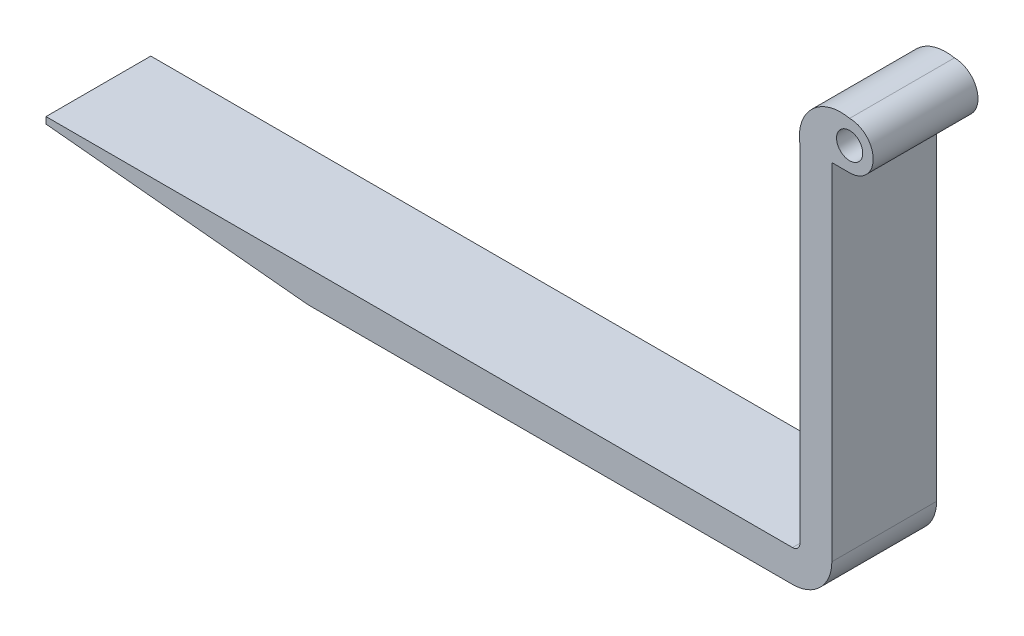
ISO-10303-21;
HEADER;
FILE_DESCRIPTION(('STEP AP214'),'2;1');
FILE_NAME('part.step','',(''),(''),'','','');
FILE_SCHEMA(('AUTOMOTIVE_DESIGN { 1 0 10303 214 1 1 1 1 }'));
ENDSEC;
DATA;
#1=APPLICATION_CONTEXT('core data for automotive mechanical design processes');
#2=APPLICATION_PROTOCOL_DEFINITION('international standard','automotive_design',2000,#1);
#3=PRODUCT_CONTEXT('',#1,'mechanical');
#4=PRODUCT('Part','Part','',(#3));
#5=PRODUCT_RELATED_PRODUCT_CATEGORY('part','',(#4));
#6=PRODUCT_DEFINITION_FORMATION('','',#4);
#7=PRODUCT_DEFINITION_CONTEXT('part definition',#1,'design');
#8=PRODUCT_DEFINITION('design','',#6,#7);
#9=PRODUCT_DEFINITION_SHAPE('','',#8);
#10=(LENGTH_UNIT() NAMED_UNIT(*) SI_UNIT(.MILLI.,.METRE.));
#11=(NAMED_UNIT(*) PLANE_ANGLE_UNIT() SI_UNIT($,.RADIAN.));
#12=(NAMED_UNIT(*) SI_UNIT($,.STERADIAN.) SOLID_ANGLE_UNIT());
#13=UNCERTAINTY_MEASURE_WITH_UNIT(LENGTH_MEASURE(1.E-05),#10,'distance_accuracy_value','');
#14=(GEOMETRIC_REPRESENTATION_CONTEXT(3) GLOBAL_UNCERTAINTY_ASSIGNED_CONTEXT((#13)) GLOBAL_UNIT_ASSIGNED_CONTEXT((#10,
#11,#12)) REPRESENTATION_CONTEXT('',''));
#15=CARTESIAN_POINT('',(0.,0.,0.));
#16=DIRECTION('',(0.,0.,1.));
#17=DIRECTION('',(1.,0.,0.));
#18=AXIS2_PLACEMENT_3D('',#15,#16,#17);
#19=CARTESIAN_POINT('',(0.,0.,-200.));
#20=DIRECTION('',(1.,0.,0.));
#21=DIRECTION('',(0.,1.,0.));
#22=AXIS2_PLACEMENT_3D('',#19,#20,#21);
#23=PLANE('',#22);
#24=DIRECTION('',(0.,1.,0.));
#25=VECTOR('',#24,1.);
#26=CARTESIAN_POINT('',(0.,0.,0.));
#27=LINE('',#26,#25);
#28=CARTESIAN_POINT('',(0.,-659.999999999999,0.));
#29=VERTEX_POINT('',#28);
#30=CARTESIAN_POINT('',(0.,0.,0.));
#31=VERTEX_POINT('',#30);
#32=EDGE_CURVE('E162',#29,#31,#27,.T.);
#33=ORIENTED_EDGE('',*,*,#32,.F.);
#34=DIRECTION('',(0.,0.,1.));
#35=VECTOR('',#34,1.);
#36=CARTESIAN_POINT('',(0.,-659.999999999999,-200.));
#37=LINE('',#36,#35);
#38=CARTESIAN_POINT('',(0.,-659.999999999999,-200.));
#39=VERTEX_POINT('',#38);
#40=EDGE_CURVE('E48',#39,#29,#37,.T.);
#41=ORIENTED_EDGE('',*,*,#40,.F.);
#42=DIRECTION('',(0.,1.,0.));
#43=VECTOR('',#42,1.);
#44=CARTESIAN_POINT('',(0.,0.,-200.));
#45=LINE('',#44,#43);
#46=CARTESIAN_POINT('',(0.,0.,-200.));
#47=VERTEX_POINT('',#46);
#48=EDGE_CURVE('E142',#39,#47,#45,.T.);
#49=ORIENTED_EDGE('',*,*,#48,.T.);
#50=DIRECTION('',(0.,0.,1.));
#51=VECTOR('',#50,1.);
#52=CARTESIAN_POINT('',(0.,0.,-200.));
#53=LINE('',#52,#51);
#54=EDGE_CURVE('E11',#47,#31,#53,.T.);
#55=ORIENTED_EDGE('',*,*,#54,.T.);
#56=EDGE_LOOP('',(#33,#41,#49,#55));
#57=FACE_BOUND('',#56,.T.);
#58=ADVANCED_FACE('F38',(#57),#23,.T.);
#59=CARTESIAN_POINT('',(-74.9999999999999,-660.,-200.));
#60=DIRECTION('',(0.,0.,1.));
#61=DIRECTION('',(1.,0.,0.));
#62=AXIS2_PLACEMENT_3D('',#59,#60,#61);
#63=CYLINDRICAL_SURFACE('',#62,75.);
#64=CARTESIAN_POINT('',(-74.9999999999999,-660.,0.));
#65=DIRECTION('',(0.,0.,1.));
#66=DIRECTION('',(-1.,0.,0.));
#67=AXIS2_PLACEMENT_3D('',#64,#65,#66);
#68=CIRCLE('',#67,75.);
#69=CARTESIAN_POINT('',(-75.0000000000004,-735.,0.));
#70=VERTEX_POINT('',#69);
#71=EDGE_CURVE('E160',#70,#29,#68,.T.);
#72=ORIENTED_EDGE('',*,*,#71,.F.);
#73=DIRECTION('',(0.,0.,1.));
#74=VECTOR('',#73,1.);
#75=CARTESIAN_POINT('',(-75.0000000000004,-735.,-200.));
#76=LINE('',#75,#74);
#77=CARTESIAN_POINT('',(-75.0000000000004,-735.,-200.));
#78=VERTEX_POINT('',#77);
#79=EDGE_CURVE('E86',#78,#70,#76,.T.);
#80=ORIENTED_EDGE('',*,*,#79,.F.);
#81=CARTESIAN_POINT('',(-74.9999999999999,-660.,-200.));
#82=DIRECTION('',(0.,0.,1.));
#83=DIRECTION('',(-1.,0.,0.));
#84=AXIS2_PLACEMENT_3D('',#81,#82,#83);
#85=CIRCLE('',#84,75.);
#86=EDGE_CURVE('E132',#78,#39,#85,.T.);
#87=ORIENTED_EDGE('',*,*,#86,.T.);
#88=ORIENTED_EDGE('',*,*,#40,.T.);
#89=EDGE_LOOP('',(#72,#80,#87,#88));
#90=FACE_BOUND('',#89,.T.);
#91=ADVANCED_FACE('F231',(#90),#63,.T.);
#92=CARTESIAN_POINT('',(-75.0000000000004,-735.,-200.));
#93=DIRECTION('',(0.,-1.,0.));
#94=DIRECTION('',(0.,0.,-1.));
#95=AXIS2_PLACEMENT_3D('',#92,#93,#94);
#96=PLANE('',#95);
#97=DIRECTION('',(1.,0.,0.));
#98=VECTOR('',#97,1.);
#99=CARTESIAN_POINT('',(-75.0000000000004,-735.,0.));
#100=LINE('',#99,#98);
#101=CARTESIAN_POINT('',(-1000.,-735.,0.));
#102=VERTEX_POINT('',#101);
#103=EDGE_CURVE('E115',#102,#70,#100,.T.);
#104=ORIENTED_EDGE('',*,*,#103,.F.);
#105=DIRECTION('',(0.,0.,1.));
#106=VECTOR('',#105,1.);
#107=CARTESIAN_POINT('',(-1000.,-735.,-200.));
#108=LINE('',#107,#106);
#109=CARTESIAN_POINT('',(-1000.,-735.,-200.));
#110=VERTEX_POINT('',#109);
#111=EDGE_CURVE('E110',#110,#102,#108,.T.);
#112=ORIENTED_EDGE('',*,*,#111,.F.);
#113=DIRECTION('',(1.,0.,0.));
#114=VECTOR('',#113,1.);
#115=CARTESIAN_POINT('',(-75.0000000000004,-735.,-200.));
#116=LINE('',#115,#114);
#117=EDGE_CURVE('E113',#110,#78,#116,.T.);
#118=ORIENTED_EDGE('',*,*,#117,.T.);
#119=ORIENTED_EDGE('',*,*,#79,.T.);
#120=EDGE_LOOP('',(#104,#112,#118,#119));
#121=FACE_BOUND('',#120,.T.);
#122=ADVANCED_FACE('F112',(#121),#96,.T.);
#123=CARTESIAN_POINT('',(-1500.,-686.5,-200.));
#124=DIRECTION('',(-0.0965468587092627,-0.995328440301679,0.));
#125=DIRECTION('',(0.995328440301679,-0.0965468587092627,0.));
#126=AXIS2_PLACEMENT_3D('',#123,#124,#125);
#127=PLANE('',#126);
#128=DIRECTION('',(0.995328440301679,-0.0965468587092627,0.));
#129=VECTOR('',#128,1.);
#130=CARTESIAN_POINT('',(-1500.,-686.5,0.));
#131=LINE('',#130,#129);
#132=CARTESIAN_POINT('',(-1500.,-686.5,0.));
#133=VERTEX_POINT('',#132);
#134=EDGE_CURVE('E157',#133,#102,#131,.T.);
#135=ORIENTED_EDGE('',*,*,#134,.F.);
#136=DIRECTION('',(0.,0.,1.));
#137=VECTOR('',#136,1.);
#138=CARTESIAN_POINT('',(-1500.,-686.5,-200.));
#139=LINE('',#138,#137);
#140=CARTESIAN_POINT('',(-1500.,-686.5,-200.));
#141=VERTEX_POINT('',#140);
#142=EDGE_CURVE('E120',#141,#133,#139,.T.);
#143=ORIENTED_EDGE('',*,*,#142,.F.);
#144=DIRECTION('',(0.995328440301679,-0.0965468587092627,0.));
#145=VECTOR('',#144,1.);
#146=CARTESIAN_POINT('',(-1500.,-686.5,-200.));
#147=LINE('',#146,#145);
#148=EDGE_CURVE('E129',#141,#110,#147,.T.);
#149=ORIENTED_EDGE('',*,*,#148,.T.);
#150=ORIENTED_EDGE('',*,*,#111,.T.);
#151=EDGE_LOOP('',(#135,#143,#149,#150));
#152=FACE_BOUND('',#151,.T.);
#153=ADVANCED_FACE('F134',(#152),#127,.T.);
#154=CARTESIAN_POINT('',(-1500.,-674.,-200.));
#155=DIRECTION('',(-1.,0.,0.));
#156=DIRECTION('',(0.,0.,1.));
#157=AXIS2_PLACEMENT_3D('',#154,#155,#156);
#158=PLANE('',#157);
#159=DIRECTION('',(0.,-1.,0.));
#160=VECTOR('',#159,1.);
#161=CARTESIAN_POINT('',(-1500.,-674.,0.));
#162=LINE('',#161,#160);
#163=CARTESIAN_POINT('',(-1500.,-674.,0.));
#164=VERTEX_POINT('',#163);
#165=EDGE_CURVE('E154',#164,#133,#162,.T.);
#166=ORIENTED_EDGE('',*,*,#165,.F.);
#167=DIRECTION('',(0.,0.,1.));
#168=VECTOR('',#167,1.);
#169=CARTESIAN_POINT('',(-1500.,-674.,-200.));
#170=LINE('',#169,#168);
#171=CARTESIAN_POINT('',(-1500.,-674.,-200.));
#172=VERTEX_POINT('',#171);
#173=EDGE_CURVE('E169',#172,#164,#170,.T.);
#174=ORIENTED_EDGE('',*,*,#173,.F.);
#175=DIRECTION('',(0.,-1.,0.));
#176=VECTOR('',#175,1.);
#177=CARTESIAN_POINT('',(-1500.,-674.,-200.));
#178=LINE('',#177,#176);
#179=EDGE_CURVE('E135',#172,#141,#178,.T.);
#180=ORIENTED_EDGE('',*,*,#179,.T.);
#181=ORIENTED_EDGE('',*,*,#142,.T.);
#182=EDGE_LOOP('',(#166,#174,#180,#181));
#183=FACE_BOUND('',#182,.T.);
#184=ADVANCED_FACE('F221',(#183),#158,.T.);
#185=CARTESIAN_POINT('',(-75.,-674.,-200.));
#186=DIRECTION('',(0.,1.,0.));
#187=DIRECTION('',(-1.,0.,0.));
#188=AXIS2_PLACEMENT_3D('',#185,#186,#187);
#189=PLANE('',#188);
#190=DIRECTION('',(-1.,0.,0.));
#191=VECTOR('',#190,1.);
#192=CARTESIAN_POINT('',(-75.,-674.,0.));
#193=LINE('',#192,#191);
#194=CARTESIAN_POINT('',(-75.,-674.,0.));
#195=VERTEX_POINT('',#194);
#196=EDGE_CURVE('E151',#195,#164,#193,.T.);
#197=ORIENTED_EDGE('',*,*,#196,.F.);
#198=DIRECTION('',(0.,0.,1.));
#199=VECTOR('',#198,1.);
#200=CARTESIAN_POINT('',(-75.,-674.,-200.));
#201=LINE('',#200,#199);
#202=CARTESIAN_POINT('',(-75.,-674.,-200.));
#203=VERTEX_POINT('',#202);
#204=EDGE_CURVE('E171',#203,#195,#201,.T.);
#205=ORIENTED_EDGE('',*,*,#204,.F.);
#206=DIRECTION('',(-1.,0.,0.));
#207=VECTOR('',#206,1.);
#208=CARTESIAN_POINT('',(-75.,-674.,-200.));
#209=LINE('',#208,#207);
#210=EDGE_CURVE('E137',#203,#172,#209,.T.);
#211=ORIENTED_EDGE('',*,*,#210,.T.);
#212=ORIENTED_EDGE('',*,*,#173,.T.);
#213=EDGE_LOOP('',(#197,#205,#211,#212));
#214=FACE_BOUND('',#213,.T.);
#215=ADVANCED_FACE('F217',(#214),#189,.T.);
#216=CARTESIAN_POINT('',(-74.9999999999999,-660.,-200.));
#217=DIRECTION('',(0.,0.,1.));
#218=DIRECTION('',(1.,0.,0.));
#219=AXIS2_PLACEMENT_3D('',#216,#217,#218);
#220=CYLINDRICAL_SURFACE('',#219,14.);
#221=CARTESIAN_POINT('',(-74.9999999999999,-660.,0.));
#222=DIRECTION('',(0.,0.,-1.));
#223=DIRECTION('',(-1.,0.,0.));
#224=AXIS2_PLACEMENT_3D('',#221,#222,#223);
#225=CIRCLE('',#224,14.);
#226=CARTESIAN_POINT('',(-61.,-659.999999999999,0.));
#227=VERTEX_POINT('',#226);
#228=EDGE_CURVE('E147',#227,#195,#225,.T.);
#229=ORIENTED_EDGE('',*,*,#228,.F.);
#230=DIRECTION('',(0.,0.,1.));
#231=VECTOR('',#230,1.);
#232=CARTESIAN_POINT('',(-61.,-659.999999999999,-200.));
#233=LINE('',#232,#231);
#234=CARTESIAN_POINT('',(-61.,-659.999999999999,-200.));
#235=VERTEX_POINT('',#234);
#236=EDGE_CURVE('E97',#235,#227,#233,.T.);
#237=ORIENTED_EDGE('',*,*,#236,.F.);
#238=CARTESIAN_POINT('',(-74.9999999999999,-660.,-200.));
#239=DIRECTION('',(0.,0.,-1.));
#240=DIRECTION('',(-1.,0.,0.));
#241=AXIS2_PLACEMENT_3D('',#238,#239,#240);
#242=CIRCLE('',#241,14.);
#243=EDGE_CURVE('E212',#235,#203,#242,.T.);
#244=ORIENTED_EDGE('',*,*,#243,.T.);
#245=ORIENTED_EDGE('',*,*,#204,.T.);
#246=EDGE_LOOP('',(#229,#237,#244,#245));
#247=FACE_BOUND('',#246,.T.);
#248=ADVANCED_FACE('F219',(#247),#220,.F.);
#249=CARTESIAN_POINT('',(-61.,0.,-200.));
#250=DIRECTION('',(-1.,0.,0.));
#251=DIRECTION('',(0.,0.,1.));
#252=AXIS2_PLACEMENT_3D('',#249,#250,#251);
#253=PLANE('',#252);
#254=DIRECTION('',(0.,-1.,0.));
#255=VECTOR('',#254,1.);
#256=CARTESIAN_POINT('',(-61.,0.,0.));
#257=LINE('',#256,#255);
#258=CARTESIAN_POINT('',(-61.,0.,0.));
#259=VERTEX_POINT('',#258);
#260=EDGE_CURVE('E144',#259,#227,#257,.T.);
#261=ORIENTED_EDGE('',*,*,#260,.F.);
#262=DIRECTION('',(0.,0.,1.));
#263=VECTOR('',#262,1.);
#264=CARTESIAN_POINT('',(-61.,0.,-200.));
#265=LINE('',#264,#263);
#266=CARTESIAN_POINT('',(-61.,0.,-200.));
#267=VERTEX_POINT('',#266);
#268=EDGE_CURVE('E42',#267,#259,#265,.T.);
#269=ORIENTED_EDGE('',*,*,#268,.F.);
#270=DIRECTION('',(0.,-1.,0.));
#271=VECTOR('',#270,1.);
#272=CARTESIAN_POINT('',(-61.,0.,-200.));
#273=LINE('',#272,#271);
#274=EDGE_CURVE('E164',#267,#235,#273,.T.);
#275=ORIENTED_EDGE('',*,*,#274,.T.);
#276=ORIENTED_EDGE('',*,*,#236,.T.);
#277=EDGE_LOOP('',(#261,#269,#275,#276));
#278=FACE_BOUND('',#277,.T.);
#279=ADVANCED_FACE('F40',(#278),#253,.T.);
#280=CARTESIAN_POINT('',(-74.9999999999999,-660.,-200.));
#281=DIRECTION('',(0.,0.,-1.));
#282=DIRECTION('',(-1.,0.,0.));
#283=AXIS2_PLACEMENT_3D('',#280,#281,#282);
#284=PLANE('',#283);
#285=ORIENTED_EDGE('',*,*,#274,.F.);
#286=CARTESIAN_POINT('',(17.349649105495,12.4364814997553,-200.));
#287=DIRECTION('',(0.,0.,1.));
#288=DIRECTION('',(1.,0.,0.));
#289=AXIS2_PLACEMENT_3D('',#286,#287,#288);
#290=CIRCLE('',#289,79.3305337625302);
#291=CARTESIAN_POINT('',(34.,90.,-200.));
#292=VERTEX_POINT('',#291);
#293=EDGE_CURVE('E187',#267,#292,#290,.F.);
#294=ORIENTED_EDGE('',*,*,#293,.T.);
#295=CARTESIAN_POINT('',(34.,45.,-200.));
#296=DIRECTION('',(0.,0.,1.));
#297=DIRECTION('',(1.,0.,0.));
#298=AXIS2_PLACEMENT_3D('',#295,#296,#297);
#299=CIRCLE('',#298,45.);
#300=CARTESIAN_POINT('',(34.,0.,-200.));
#301=VERTEX_POINT('',#300);
#302=EDGE_CURVE('E343',#301,#292,#299,.T.);
#303=ORIENTED_EDGE('',*,*,#302,.F.);
#304=DIRECTION('',(-1.,0.,0.));
#305=VECTOR('',#304,1.);
#306=CARTESIAN_POINT('',(0.,0.,-200.));
#307=LINE('',#306,#305);
#308=EDGE_CURVE('E345',#301,#47,#307,.T.);
#309=ORIENTED_EDGE('',*,*,#308,.T.);
#310=ORIENTED_EDGE('',*,*,#48,.F.);
#311=ORIENTED_EDGE('',*,*,#86,.F.);
#312=ORIENTED_EDGE('',*,*,#117,.F.);
#313=ORIENTED_EDGE('',*,*,#148,.F.);
#314=ORIENTED_EDGE('',*,*,#179,.F.);
#315=ORIENTED_EDGE('',*,*,#210,.F.);
#316=ORIENTED_EDGE('',*,*,#243,.F.);
#317=EDGE_LOOP('',(#285,#294,#303,#309,#310,#311,#312,#313,#314,#315,#316));
#318=FACE_BOUND('',#317,.T.);
#319=CARTESIAN_POINT('',(34.,45.,-200.));
#320=DIRECTION('',(0.,0.,1.));
#321=DIRECTION('',(1.,0.,0.));
#322=AXIS2_PLACEMENT_3D('',#319,#320,#321);
#323=CIRCLE('',#322,25.);
#324=CARTESIAN_POINT('',(59.,45.,-200.));
#325=VERTEX_POINT('',#324);
#326=EDGE_CURVE('E199',#325,#325,#323,.T.);
#327=ORIENTED_EDGE('',*,*,#326,.T.);
#328=EDGE_LOOP('',(#327));
#329=FACE_BOUND('',#328,.T.);
#330=ADVANCED_FACE('F126',(#318,#329),#284,.T.);
#331=CARTESIAN_POINT('',(-74.9999999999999,-660.,0.));
#332=DIRECTION('',(0.,0.,-1.));
#333=DIRECTION('',(-1.,0.,0.));
#334=AXIS2_PLACEMENT_3D('',#331,#332,#333);
#335=PLANE('',#334);
#336=ORIENTED_EDGE('',*,*,#32,.T.);
#337=DIRECTION('',(-1.,0.,0.));
#338=VECTOR('',#337,1.);
#339=CARTESIAN_POINT('',(0.,0.,0.));
#340=LINE('',#339,#338);
#341=CARTESIAN_POINT('',(34.,0.,0.));
#342=VERTEX_POINT('',#341);
#343=EDGE_CURVE('E194',#342,#31,#340,.T.);
#344=ORIENTED_EDGE('',*,*,#343,.F.);
#345=CARTESIAN_POINT('',(34.,45.,0.));
#346=DIRECTION('',(0.,0.,1.));
#347=DIRECTION('',(1.,0.,0.));
#348=AXIS2_PLACEMENT_3D('',#345,#346,#347);
#349=CIRCLE('',#348,45.);
#350=CARTESIAN_POINT('',(34.,90.,0.));
#351=VERTEX_POINT('',#350);
#352=EDGE_CURVE('E193',#342,#351,#349,.T.);
#353=ORIENTED_EDGE('',*,*,#352,.T.);
#354=CARTESIAN_POINT('',(17.349649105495,12.4364814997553,0.));
#355=DIRECTION('',(0.,0.,1.));
#356=DIRECTION('',(1.,0.,0.));
#357=AXIS2_PLACEMENT_3D('',#354,#355,#356);
#358=CIRCLE('',#357,79.3305337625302);
#359=EDGE_CURVE('E183',#259,#351,#358,.F.);
#360=ORIENTED_EDGE('',*,*,#359,.F.);
#361=ORIENTED_EDGE('',*,*,#260,.T.);
#362=ORIENTED_EDGE('',*,*,#228,.T.);
#363=ORIENTED_EDGE('',*,*,#196,.T.);
#364=ORIENTED_EDGE('',*,*,#165,.T.);
#365=ORIENTED_EDGE('',*,*,#134,.T.);
#366=ORIENTED_EDGE('',*,*,#103,.T.);
#367=ORIENTED_EDGE('',*,*,#71,.T.);
#368=EDGE_LOOP('',(#336,#344,#353,#360,#361,#362,#363,#364,#365,#366,#367));
#369=FACE_BOUND('',#368,.T.);
#370=CARTESIAN_POINT('',(34.,45.,0.));
#371=DIRECTION('',(0.,0.,1.));
#372=DIRECTION('',(1.,0.,0.));
#373=AXIS2_PLACEMENT_3D('',#370,#371,#372);
#374=CIRCLE('',#373,25.);
#375=CARTESIAN_POINT('',(59.,45.,0.));
#376=VERTEX_POINT('',#375);
#377=EDGE_CURVE('E203',#376,#376,#374,.T.);
#378=ORIENTED_EDGE('',*,*,#377,.F.);
#379=EDGE_LOOP('',(#378));
#380=FACE_BOUND('',#379,.T.);
#381=ADVANCED_FACE('F189',(#369,#380),#335,.F.);
#382=CARTESIAN_POINT('',(17.349649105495,12.4364814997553,-200.));
#383=DIRECTION('',(0.,0.,1.));
#384=DIRECTION('',(1.,0.,0.));
#385=AXIS2_PLACEMENT_3D('',#382,#383,#384);
#386=CYLINDRICAL_SURFACE('',#385,79.3305337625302);
#387=ORIENTED_EDGE('',*,*,#359,.T.);
#388=DIRECTION('',(0.,0.,1.));
#389=VECTOR('',#388,1.);
#390=CARTESIAN_POINT('',(34.,90.,-200.));
#391=LINE('',#390,#389);
#392=EDGE_CURVE('E148',#292,#351,#391,.T.);
#393=ORIENTED_EDGE('',*,*,#392,.F.);
#394=ORIENTED_EDGE('',*,*,#293,.F.);
#395=ORIENTED_EDGE('',*,*,#268,.T.);
#396=EDGE_LOOP('',(#387,#393,#394,#395));
#397=FACE_BOUND('',#396,.T.);
#398=ADVANCED_FACE('F180',(#397),#386,.T.);
#399=CARTESIAN_POINT('',(34.,45.,-200.));
#400=DIRECTION('',(0.,0.,1.));
#401=DIRECTION('',(1.,0.,0.));
#402=AXIS2_PLACEMENT_3D('',#399,#400,#401);
#403=CYLINDRICAL_SURFACE('',#402,45.);
#404=ORIENTED_EDGE('',*,*,#352,.F.);
#405=DIRECTION('',(0.,0.,1.));
#406=VECTOR('',#405,1.);
#407=CARTESIAN_POINT('',(34.,0.,-200.));
#408=LINE('',#407,#406);
#409=EDGE_CURVE('E208',#301,#342,#408,.T.);
#410=ORIENTED_EDGE('',*,*,#409,.F.);
#411=ORIENTED_EDGE('',*,*,#302,.T.);
#412=ORIENTED_EDGE('',*,*,#392,.T.);
#413=EDGE_LOOP('',(#404,#410,#411,#412));
#414=FACE_BOUND('',#413,.T.);
#415=ADVANCED_FACE('F304',(#414),#403,.T.);
#416=CARTESIAN_POINT('',(0.,0.,-200.));
#417=DIRECTION('',(0.,1.,0.));
#418=DIRECTION('',(0.,0.,1.));
#419=AXIS2_PLACEMENT_3D('',#416,#417,#418);
#420=PLANE('',#419);
#421=ORIENTED_EDGE('',*,*,#54,.F.);
#422=ORIENTED_EDGE('',*,*,#308,.F.);
#423=ORIENTED_EDGE('',*,*,#409,.T.);
#424=ORIENTED_EDGE('',*,*,#343,.T.);
#425=EDGE_LOOP('',(#421,#422,#423,#424));
#426=FACE_BOUND('',#425,.T.);
#427=ADVANCED_FACE('F313',(#426),#420,.F.);
#428=CARTESIAN_POINT('',(34.,45.,-200.));
#429=DIRECTION('',(0.,0.,1.));
#430=DIRECTION('',(1.,0.,0.));
#431=AXIS2_PLACEMENT_3D('',#428,#429,#430);
#432=CYLINDRICAL_SURFACE('',#431,25.);
#433=ORIENTED_EDGE('',*,*,#326,.F.);
#434=EDGE_LOOP('',(#433));
#435=FACE_BOUND('',#434,.T.);
#436=ORIENTED_EDGE('',*,*,#377,.T.);
#437=EDGE_LOOP('',(#436));
#438=FACE_BOUND('',#437,.T.);
#439=ADVANCED_FACE('F324',(#435,#438),#432,.F.);
#440=CLOSED_SHELL('',(#58,#91,#122,#153,#184,#215,#248,#279,#330,#381,#398,#415,#427,#439));
#441=MANIFOLD_SOLID_BREP('B2',#440);
#442=ADVANCED_BREP_SHAPE_REPRESENTATION('',(#18,#441),#14);
#443=SHAPE_DEFINITION_REPRESENTATION(#9,#442);
ENDSEC;
END-ISO-10303-21;
